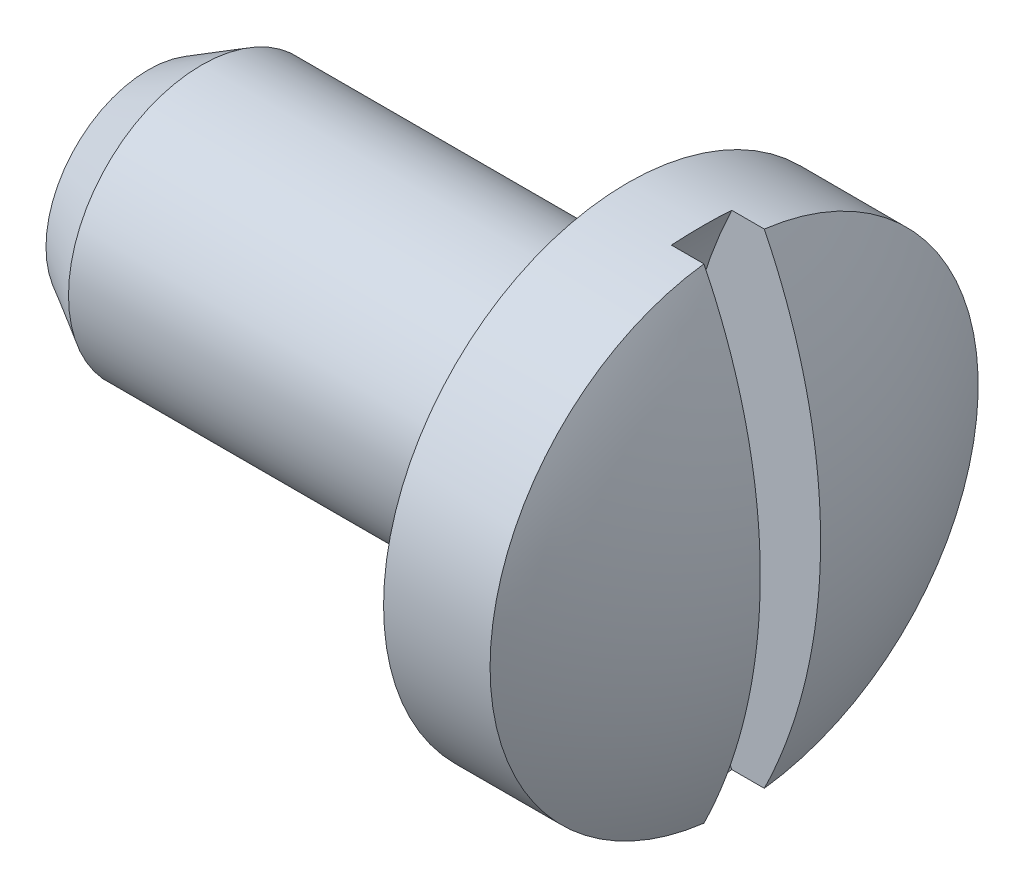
from build123d import *

# Parameters (mm, degrees)
CUT_EXTRUDE1_DEPTH = 0.4318


with BuildPart() as part:
    # Sketch1 → Revolve1 (revolve)
    with BuildSketch(Plane.XY, mode=Mode.PRIVATE) as revolve1_sk:
        with BuildLine():
            Line((0, 0), (0, 1.465059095))
            Line((0, 1.465059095), (0.762, 1.905))
            Line((0.762, 1.905), (6.604, 1.905))
            ThreePointArc((6.604, 1.905), (6.783605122, 1.979394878), (6.858, 2.159))
            Line((6.858, 2.159), (6.858, 3.4925))
            Line((6.858, 3.4925), (8.382, 3.4925))
            ThreePointArc((8.382, 3.4925), (8.991973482, 1.793385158), (9.198924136, 0))
            Line((9.198924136, 0), (0, 0))
        make_face()
    revolve(revolve1_sk.sketch.rotate(Axis((0, 0, 0), (1, 0, 0)), 90), axis=Axis((0, 0, 0), (1, 0, 0)))

    # Sketch2 → Cut-Extrude1 (cut, symmetric)
    with BuildSketch(Plane.XY):
        with BuildLine():
            Line((7.928924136, 3.4925), (9.647641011, 6.504980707))
            Line((9.647641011, 6.504980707), (14.118393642, -2.041518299))
            Line((14.118393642, -2.041518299), (8.283073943, -5.363161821))
            Line((8.283073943, -5.363161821), (7.928924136, -3.4925))
            ThreePointArc((7.928924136, -3.4925), (7.134828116, 0), (7.928924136, 3.4925))
        make_face()
    extrude(amount=CUT_EXTRUDE1_DEPTH, both=True, mode=Mode.SUBTRACT)


solid = part.part
